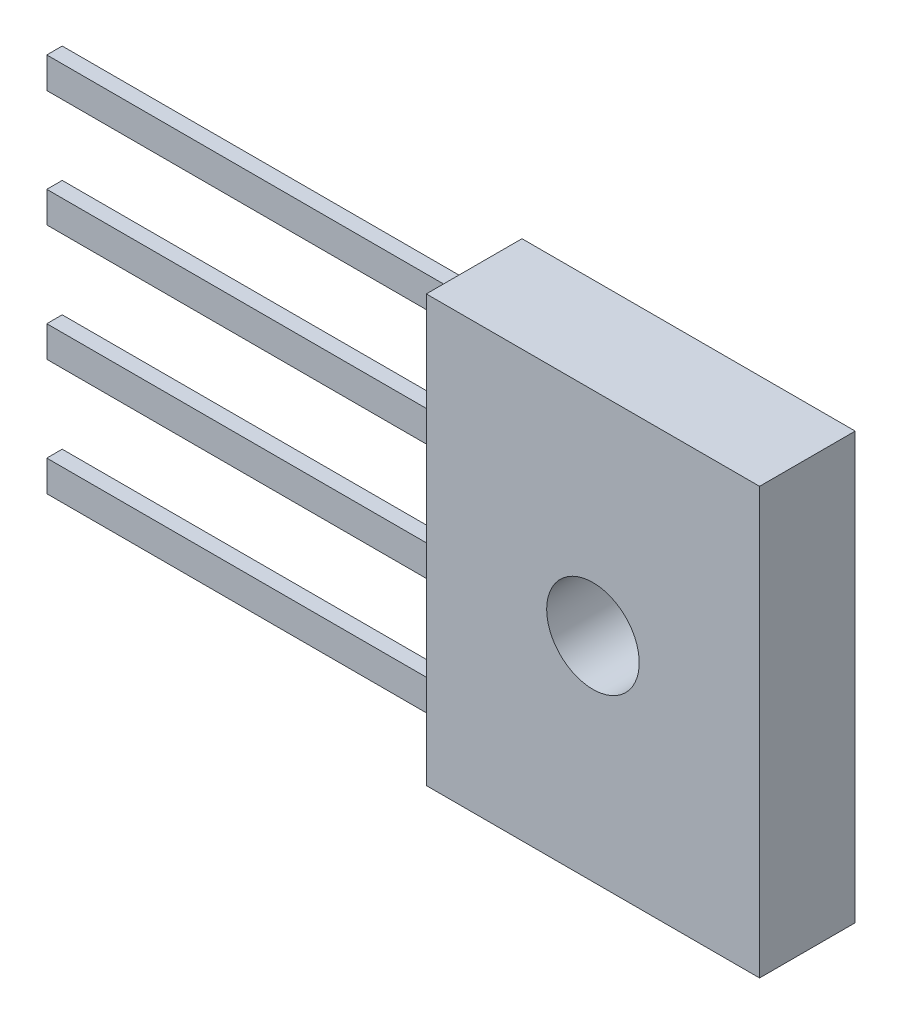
from build123d import *

# Parameters (mm, degrees)
ESQUISSE1_W             = 10.8
ESQUISSE1_H             = 13.8
ESQUISSE1_R             = 1.5
BOSS_EXTRU_1_DEPTH      = 1.55
ESQUISSE2_W             = 0.5
ESQUISSE2_H             = 1
BOSS_EXTRU_2_DEPTH      = 13.6
ESQUISSE4_R             = 1.6
ENL_V_MAT_EXTRU_2_DEPTH = 0.5


with BuildPart() as part:
    # Esquisse1 → Boss.-Extru.1 (new, symmetric)
    with BuildSketch(Plane.XY):
        Rectangle(ESQUISSE1_W, ESQUISSE1_H)
        with Locations(Location((0, 0, 0), (0, 0, 180))):
            Circle(ESQUISSE1_R, mode=Mode.SUBTRACT)
    extrude(amount=BOSS_EXTRU_1_DEPTH, both=True)

    # Esquisse2 → Boss.-Extru.2 (add)
    with BuildSketch(Plane.ZY.offset(5.4)):
        with Locations((0, 5.657823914)):
            Rectangle(ESQUISSE2_W, ESQUISSE2_H)
        with Locations((0, 1.885941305)):
            Rectangle(ESQUISSE2_W, ESQUISSE2_H)
        with Locations((0, -1.885941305)):
            Rectangle(ESQUISSE2_W, ESQUISSE2_H)
        with Locations((0, -5.657823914)):
            Rectangle(ESQUISSE2_W, ESQUISSE2_H)
    extrude(amount=BOSS_EXTRU_2_DEPTH)

    # Esquisse4 → Enl_v. mat.-Extru.2 (cut)
    with BuildSketch(Plane(origin=(0, 0, -1.55), x_dir=(-1, 0, 0), z_dir=(0, 0, -1))):
        with Locations((0, -6.9)):
            Circle(ESQUISSE4_R)
    extrude(amount=-ENL_V_MAT_EXTRU_2_DEPTH, mode=Mode.SUBTRACT)


solid = part.part
